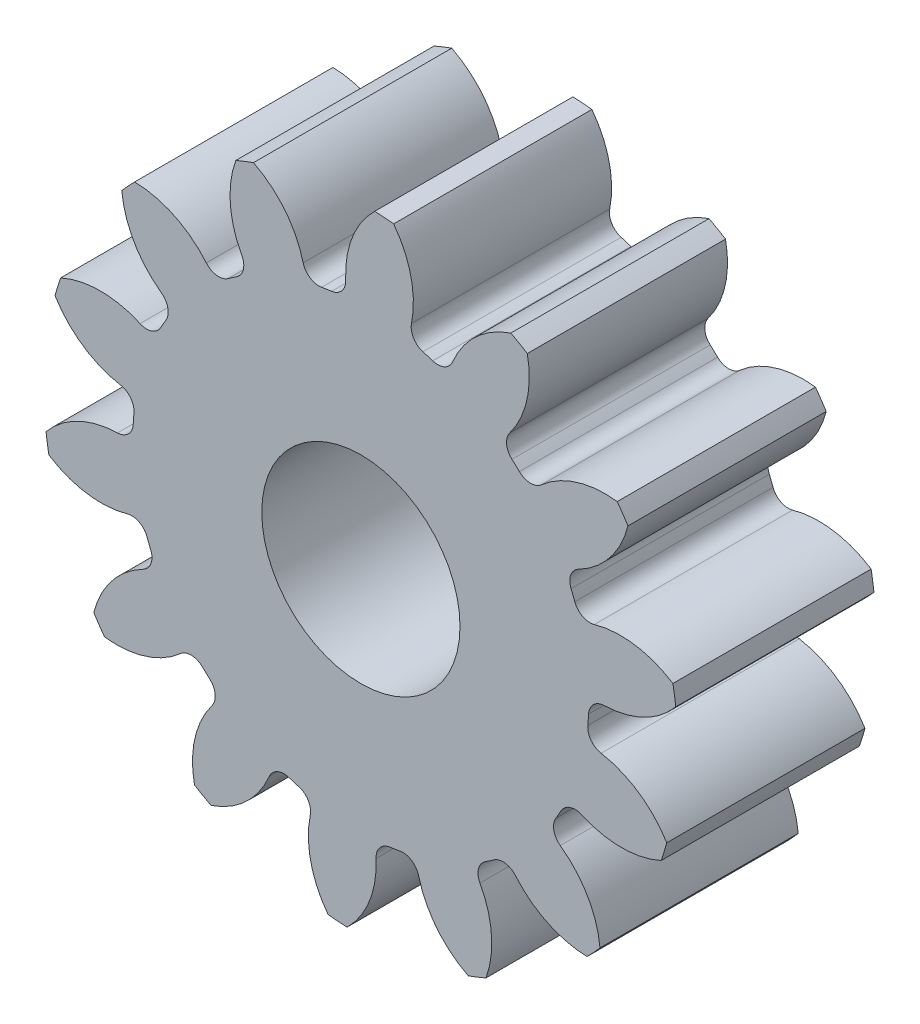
from build123d import *

# Parameters (mm, degrees)
SKETCH3_R         = 162.56
GEARBODY_DEPTH    = 101.6
TOOTHCUT_DEPTH    = 252.344518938
CIRPATTERN1_COUNT = 14
BOREDIA_R         = 50.8
BORE_DEPTH        = 12700


with BuildPart() as part:
    # Sketch3 → gearBody (new body)
    with BuildSketch(Plane.XY):
        Circle(SKETCH3_R)
    extrude(amount=GEARBODY_DEPTH)

    # Sketch2 → toothCut (cut, through all)
    with BuildSketch(Plane.XY):
        with BuildLine():
            ThreePointArc((116.303503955, -11.183942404), (116.524169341, -8.585077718), (116.686768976, -5.981934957))
            ThreePointArc((116.686768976, -5.981934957), (119.174384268, -0.48222426), (124.736628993, 1.862233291))
            ThreePointArc((124.736628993, 1.862233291), (145.821140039, 7.194867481), (162.56, 21.080261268))
            ThreePointArc((162.56, 21.080261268), (163.478016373, -12.044466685), (157.715245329, -44.676978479))
            ThreePointArc((157.715245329, -44.676978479), (143.192132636, -28.488316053), (123.116823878, -20.123175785))
            ThreePointArc((123.116823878, -20.123175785), (117.958236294, -16.988846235), (116.303503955, -11.183942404))
        make_face()
    toothcut = extrude(amount=TOOTHCUT_DEPTH, mode=Mode.SUBTRACT)

    # CirPattern1: toothCut ×14 about axis
    cirpattern1_axis = Axis((0, 0, 0), (0, 0, 1))
    for i in range(1, CIRPATTERN1_COUNT):
        add(toothcut.rotate(cirpattern1_axis, i * 360 / CIRPATTERN1_COUNT), mode=Mode.SUBTRACT)

    # boreDia → bore (cut, symmetric)
    with BuildSketch(Plane.XY):
        Circle(BOREDIA_R)
    extrude(amount=BORE_DEPTH, both=True, mode=Mode.SUBTRACT)


solid = part.part
